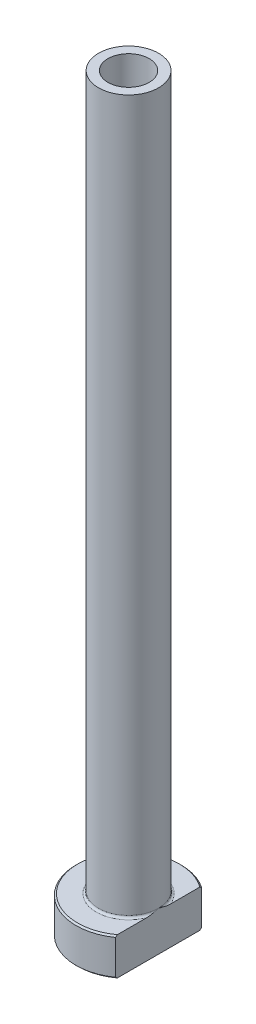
from build123d import *

# Parameters (mm, degrees)
FILLET1_R          = 0.3
CHAMFER1_SIZE      = 0.2
CUT_EXTRUDE1_DEPTH = 101.488805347
CHAMFER2_SIZE      = 0.5


with BuildPart() as part:
    # Sketch1 → Revolve1 (revolve)
    with BuildSketch(Plane.XY, mode=Mode.PRIVATE) as revolve1_sk:
        Polygon((-2.75, 100), (-4, 100), (-4, 5), (-7, 5), (-7, 0), (-3, 0), (-3, 43), (-2.75, 55), align=None)
    revolve(revolve1_sk.sketch.rotate(Axis((0, 92.187680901, 0), (0, -1, 0)), 270), axis=Axis((0, 92.187680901, 0), (0, -1, 0)))

    # Fillet1
    fillet1_edges = [part.edges().sort_by_distance(p)[0] for p in [
        (0, 5, -4),
    ]]
    fillet(fillet1_edges, radius=FILLET1_R)

    # Chamfer1
    chamfer1_edges = [part.edges().sort_by_distance(p)[0] for p in [
        (0, 0, -7),
        (0, 5, -7),
    ]]
    chamfer(chamfer1_edges, length=CHAMFER1_SIZE)

    # Sketch2 → Cut-Extrude1 (cut, through all)
    with BuildSketch(Plane.XZ):
        with BuildLine():
            Line((4, 5.744562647), (4, -5.744562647))
            ThreePointArc((4, -5.744562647), (7, 0), (4, 5.744562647))
        make_face()
    extrude(amount=-CUT_EXTRUDE1_DEPTH, mode=Mode.SUBTRACT)

    # Chamfer2
    chamfer2_edges = [part.edges().sort_by_distance(p)[0] for p in [
        (0, 0, -3),
    ]]
    chamfer(chamfer2_edges, length=CHAMFER2_SIZE)


solid = part.part
